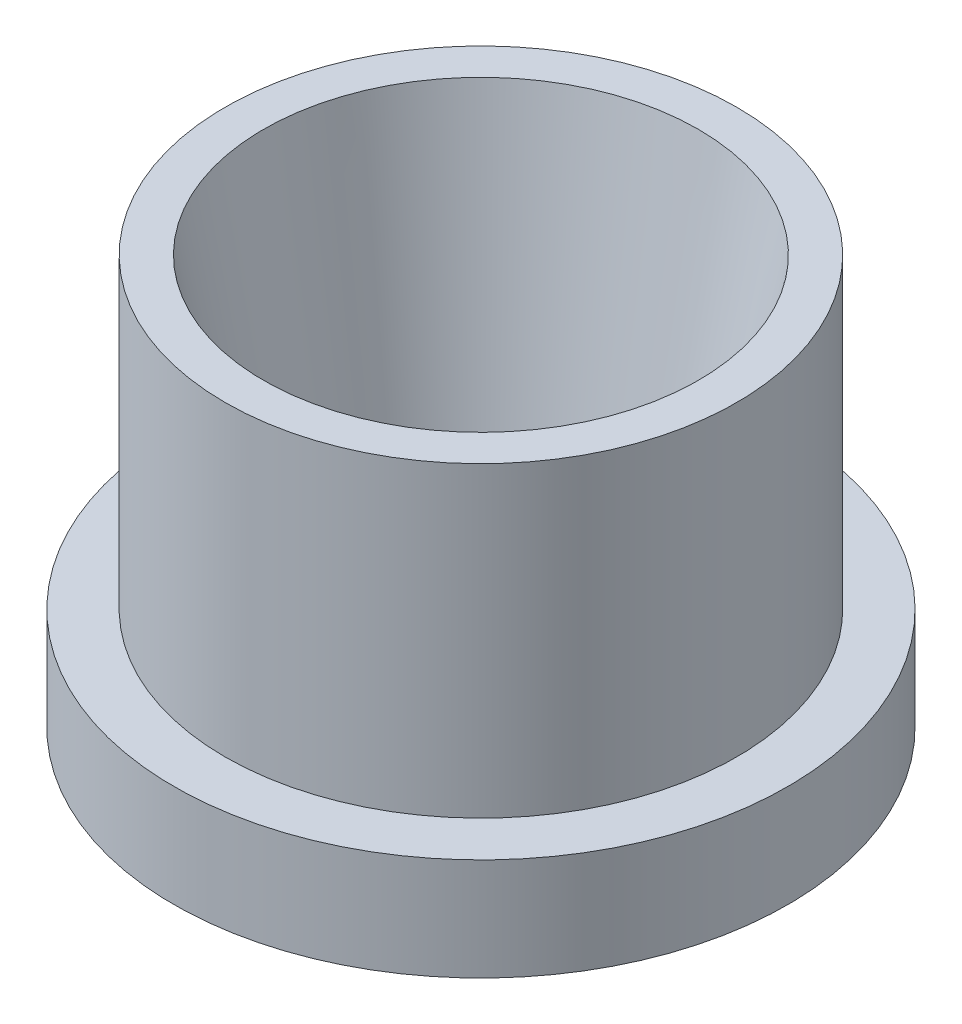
from build123d import *


with BuildPart() as part:
    # Esquisse1 → R_volution1 (revolve)
    with BuildSketch(Plane.XY, mode=Mode.PRIVATE) as r_volution1_sk:
        Polygon((2.790145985, 0), (4.25, 8), (5, 8), (5, 2), (6, 2), (6, 0), align=None)
    revolve(r_volution1_sk.sketch.rotate(Axis((0, 0, 0), (0, 1, 0)), 90), axis=Axis((0, 0, 0), (0, 1, 0)))


solid = part.part
